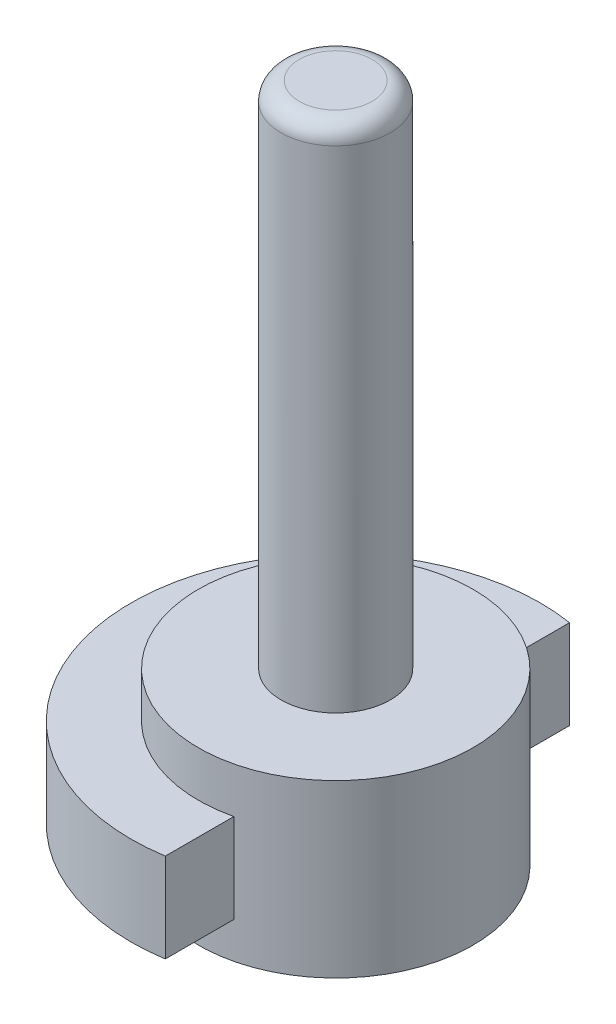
ISO-10303-21;
HEADER;
FILE_DESCRIPTION(('STEP AP214'),'2;1');
FILE_NAME('part.step','',(''),(''),'','','');
FILE_SCHEMA(('AUTOMOTIVE_DESIGN { 1 0 10303 214 1 1 1 1 }'));
ENDSEC;
DATA;
#1=APPLICATION_CONTEXT('core data for automotive mechanical design processes');
#2=APPLICATION_PROTOCOL_DEFINITION('international standard','automotive_design',2000,#1);
#3=PRODUCT_CONTEXT('',#1,'mechanical');
#4=PRODUCT('Part','Part','',(#3));
#5=PRODUCT_RELATED_PRODUCT_CATEGORY('part','',(#4));
#6=PRODUCT_DEFINITION_FORMATION('','',#4);
#7=PRODUCT_DEFINITION_CONTEXT('part definition',#1,'design');
#8=PRODUCT_DEFINITION('design','',#6,#7);
#9=PRODUCT_DEFINITION_SHAPE('','',#8);
#10=(LENGTH_UNIT() NAMED_UNIT(*) SI_UNIT(.MILLI.,.METRE.));
#11=(NAMED_UNIT(*) PLANE_ANGLE_UNIT() SI_UNIT($,.RADIAN.));
#12=(NAMED_UNIT(*) SI_UNIT($,.STERADIAN.) SOLID_ANGLE_UNIT());
#13=UNCERTAINTY_MEASURE_WITH_UNIT(LENGTH_MEASURE(1.E-05),#10,'distance_accuracy_value','');
#14=(GEOMETRIC_REPRESENTATION_CONTEXT(3) GLOBAL_UNCERTAINTY_ASSIGNED_CONTEXT((#13)) GLOBAL_UNIT_ASSIGNED_CONTEXT((#10,
#11,#12)) REPRESENTATION_CONTEXT('',''));
#15=CARTESIAN_POINT('',(0.,0.,0.));
#16=DIRECTION('',(0.,0.,1.));
#17=DIRECTION('',(1.,0.,0.));
#18=AXIS2_PLACEMENT_3D('',#15,#16,#17);
#19=CARTESIAN_POINT('',(0.,28.,0.));
#20=DIRECTION('',(0.,-1.,0.));
#21=DIRECTION('',(0.,0.,-1.));
#22=AXIS2_PLACEMENT_3D('',#19,#20,#21);
#23=CYLINDRICAL_SURFACE('',#22,3.);
#24=CARTESIAN_POINT('',(0.,27.,0.));
#25=DIRECTION('',(0.,1.,0.));
#26=DIRECTION('',(0.,0.,1.));
#27=AXIS2_PLACEMENT_3D('',#24,#25,#26);
#28=CIRCLE('',#27,3.);
#29=CARTESIAN_POINT('',(0.,27.,-3.));
#30=VERTEX_POINT('',#29);
#31=EDGE_CURVE('E37',#30,#30,#28,.F.);
#32=CARTESIAN_POINT('',(0.,0.,0.));
#33=DIRECTION('',(0.,1.,0.));
#34=DIRECTION('',(0.,0.,1.));
#35=AXIS2_PLACEMENT_3D('',#32,#33,#34);
#36=CIRCLE('',#35,3.);
#37=CARTESIAN_POINT('',(0.,0.,-3.));
#38=VERTEX_POINT('',#37);
#39=EDGE_CURVE('E104',#38,#38,#36,.T.);
#40=CARTESIAN_POINT('',(0.,27.,-3.));
#41=CARTESIAN_POINT('',(0.,26.71875,-3.));
#42=CARTESIAN_POINT('',(0.,26.4375,-3.));
#43=CARTESIAN_POINT('',(0.,25.875,-3.));
#44=CARTESIAN_POINT('',(0.,25.59375,-3.));
#45=CARTESIAN_POINT('',(0.,25.03125,-3.));
#46=CARTESIAN_POINT('',(0.,24.75,-3.));
#47=CARTESIAN_POINT('',(0.,24.1875,-3.));
#48=CARTESIAN_POINT('',(0.,23.90625,-3.));
#49=CARTESIAN_POINT('',(0.,23.34375,-3.));
#50=CARTESIAN_POINT('',(0.,23.0625,-3.));
#51=CARTESIAN_POINT('',(0.,22.5,-3.));
#52=CARTESIAN_POINT('',(0.,22.21875,-3.));
#53=CARTESIAN_POINT('',(0.,21.65625,-3.));
#54=CARTESIAN_POINT('',(0.,21.375,-3.));
#55=CARTESIAN_POINT('',(0.,20.8125,-3.));
#56=CARTESIAN_POINT('',(0.,20.53125,-3.));
#57=CARTESIAN_POINT('',(0.,19.96875,-3.));
#58=CARTESIAN_POINT('',(0.,19.6875,-3.));
#59=CARTESIAN_POINT('',(0.,19.125,-3.));
#60=CARTESIAN_POINT('',(0.,18.84375,-3.));
#61=CARTESIAN_POINT('',(0.,18.28125,-3.));
#62=CARTESIAN_POINT('',(0.,18.,-3.));
#63=CARTESIAN_POINT('',(0.,17.4375,-3.));
#64=CARTESIAN_POINT('',(0.,17.15625,-3.));
#65=CARTESIAN_POINT('',(0.,16.59375,-3.));
#66=CARTESIAN_POINT('',(0.,16.3125,-3.));
#67=CARTESIAN_POINT('',(0.,15.75,-3.));
#68=CARTESIAN_POINT('',(0.,15.46875,-3.));
#69=CARTESIAN_POINT('',(0.,14.90625,-3.));
#70=CARTESIAN_POINT('',(0.,14.625,-3.));
#71=CARTESIAN_POINT('',(0.,14.0625,-3.));
#72=CARTESIAN_POINT('',(0.,13.78125,-3.));
#73=CARTESIAN_POINT('',(0.,13.21875,-3.));
#74=CARTESIAN_POINT('',(0.,12.9375,-3.));
#75=CARTESIAN_POINT('',(0.,12.375,-3.));
#76=CARTESIAN_POINT('',(0.,12.09375,-3.));
#77=CARTESIAN_POINT('',(0.,11.53125,-3.));
#78=CARTESIAN_POINT('',(0.,11.25,-3.));
#79=CARTESIAN_POINT('',(0.,10.6875,-3.));
#80=CARTESIAN_POINT('',(0.,10.40625,-3.));
#81=CARTESIAN_POINT('',(0.,9.84375,-3.));
#82=CARTESIAN_POINT('',(0.,9.5625,-3.));
#83=CARTESIAN_POINT('',(0.,9.,-3.));
#84=CARTESIAN_POINT('',(0.,8.71875,-3.));
#85=CARTESIAN_POINT('',(0.,8.15625,-3.));
#86=CARTESIAN_POINT('',(0.,7.875,-3.));
#87=CARTESIAN_POINT('',(0.,7.3125,-3.));
#88=CARTESIAN_POINT('',(0.,7.03125,-3.));
#89=CARTESIAN_POINT('',(0.,6.46875,-3.));
#90=CARTESIAN_POINT('',(0.,6.18749999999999,-3.));
#91=CARTESIAN_POINT('',(0.,5.625,-3.));
#92=CARTESIAN_POINT('',(0.,5.34375,-3.));
#93=CARTESIAN_POINT('',(0.,4.78125,-3.));
#94=CARTESIAN_POINT('',(0.,4.5,-3.));
#95=CARTESIAN_POINT('',(0.,3.9375,-3.));
#96=CARTESIAN_POINT('',(0.,3.65625,-3.));
#97=CARTESIAN_POINT('',(0.,3.09375,-3.));
#98=CARTESIAN_POINT('',(0.,2.8125,-3.));
#99=CARTESIAN_POINT('',(0.,2.25,-3.));
#100=CARTESIAN_POINT('',(0.,1.96875,-3.));
#101=CARTESIAN_POINT('',(0.,1.40625,-3.));
#102=CARTESIAN_POINT('',(0.,1.125,-3.));
#103=CARTESIAN_POINT('',(0.,0.562499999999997,-3.));
#104=CARTESIAN_POINT('',(0.,0.281249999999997,-3.));
#105=CARTESIAN_POINT('',(0.,0.,-3.));
#106=B_SPLINE_CURVE_WITH_KNOTS('',3,(#40,#41,#42,#43,#44,#45,#46,#47,#48,#49,#50,#51,#52,#53,
#54,#55,#56,#57,#58,#59,#60,#61,#62,#63,#64,#65,#66,#67,#68,#69,#70,#71,#72,#73,#74,#75,#76,#77,
#78,#79,#80,#81,#82,#83,#84,#85,#86,#87,#88,#89,#90,#91,#92,#93,#94,#95,#96,#97,#98,#99,#100,
#101,#102,#103,#104,#105),.UNSPECIFIED.,.F.,.F.,(4,2,2,2,2,2,2,2,2,2,2,2,2,2,2,2,2,2,2,2,2,2,2,
2,2,2,2,2,2,2,2,2,4),(0.,0.843749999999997,1.6875,2.53125,3.375,4.21875,5.0625,5.90625,6.75,
7.59375,8.4375,9.28124999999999,10.125,10.96875,11.8125,12.65625,13.5,14.34375,15.1875,16.03125,
16.875,17.71875,18.5625,19.40625,20.25,21.09375,21.9375,22.78125,23.625,24.46875,25.3125,
26.15625,27.),.UNSPECIFIED.);
#107=EDGE_CURVE('BSEAM33',#30,#38,#106,.T.);
#108=ORIENTED_EDGE('',*,*,#31,.T.);
#109=ORIENTED_EDGE('',*,*,#39,.T.);
#110=ORIENTED_EDGE('',*,*,#107,.T.);
#111=ORIENTED_EDGE('',*,*,#107,.F.);
#112=EDGE_LOOP('',(#108,#110,#109,#111));
#113=FACE_BOUND('',#112,.T.);
#114=ADVANCED_FACE('F33',(#113),#23,.T.);
#115=CARTESIAN_POINT('',(0.,28.,0.));
#116=DIRECTION('',(0.,1.,0.));
#117=DIRECTION('',(0.,0.,1.));
#118=AXIS2_PLACEMENT_3D('',#115,#116,#117);
#119=PLANE('',#118);
#120=CARTESIAN_POINT('',(0.,28.,0.));
#121=DIRECTION('',(0.,1.,0.));
#122=DIRECTION('',(0.,0.,1.));
#123=AXIS2_PLACEMENT_3D('',#120,#121,#122);
#124=CIRCLE('',#123,2.);
#125=CARTESIAN_POINT('',(0.,28.,2.));
#126=VERTEX_POINT('',#125);
#127=EDGE_CURVE('E108',#126,#126,#124,.T.);
#128=ORIENTED_EDGE('',*,*,#127,.T.);
#129=EDGE_LOOP('',(#128));
#130=FACE_BOUND('',#129,.T.);
#131=ADVANCED_FACE('F131',(#130),#119,.T.);
#132=CARTESIAN_POINT('',(0.,-2.5,0.));
#133=DIRECTION('',(0.,1.,0.));
#134=DIRECTION('',(0.,0.,1.));
#135=AXIS2_PLACEMENT_3D('',#132,#133,#134);
#136=CYLINDRICAL_SURFACE('',#135,7.55);
#137=CARTESIAN_POINT('',(0.,-9.4,0.));
#138=DIRECTION('',(0.,-1.,0.));
#139=DIRECTION('',(0.,0.,-1.));
#140=AXIS2_PLACEMENT_3D('',#137,#138,#139);
#141=CIRCLE('',#140,7.55);
#142=CARTESIAN_POINT('',(0.,-9.4,-7.55));
#143=VERTEX_POINT('',#142);
#144=EDGE_CURVE('E95',#143,#143,#141,.T.);
#145=ORIENTED_EDGE('',*,*,#144,.F.);
#146=EDGE_LOOP('',(#145));
#147=FACE_BOUND('',#146,.T.);
#148=CARTESIAN_POINT('',(0.,-7.4,0.));
#149=DIRECTION('',(0.,-1.,0.));
#150=DIRECTION('',(0.,0.,-1.));
#151=AXIS2_PLACEMENT_3D('',#148,#149,#150);
#152=CIRCLE('',#151,7.55);
#153=CARTESIAN_POINT('',(1.74625496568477,-7.4,7.34527695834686));
#154=VERTEX_POINT('',#153);
#155=CARTESIAN_POINT('',(1.74625496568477,-7.4,-7.34527695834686));
#156=VERTEX_POINT('',#155);
#157=EDGE_CURVE('E11',#154,#156,#152,.T.);
#158=ORIENTED_EDGE('',*,*,#157,.T.);
#159=DIRECTION('',(0.,1.,0.));
#160=VECTOR('',#159,1.);
#161=CARTESIAN_POINT('',(1.74625496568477,-12.5,-7.34527695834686));
#162=LINE('',#161,#160);
#163=CARTESIAN_POINT('',(1.74625496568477,-2.5,-7.34527695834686));
#164=VERTEX_POINT('',#163);
#165=EDGE_CURVE('E226',#156,#164,#162,.T.);
#166=ORIENTED_EDGE('',*,*,#165,.T.);
#167=CARTESIAN_POINT('',(0.,-2.5,0.));
#168=DIRECTION('',(0.,-1.,0.));
#169=DIRECTION('',(0.,0.,-1.));
#170=AXIS2_PLACEMENT_3D('',#167,#168,#169);
#171=CIRCLE('',#170,7.55);
#172=CARTESIAN_POINT('',(1.74625496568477,-2.5,7.34527695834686));
#173=VERTEX_POINT('',#172);
#174=EDGE_CURVE('E89',#173,#164,#171,.T.);
#175=ORIENTED_EDGE('',*,*,#174,.F.);
#176=DIRECTION('',(0.,1.,0.));
#177=VECTOR('',#176,1.);
#178=CARTESIAN_POINT('',(1.74625496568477,-12.5,7.34527695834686));
#179=LINE('',#178,#177);
#180=EDGE_CURVE('E100',#154,#173,#179,.T.);
#181=ORIENTED_EDGE('',*,*,#180,.F.);
#182=EDGE_LOOP('',(#158,#166,#175,#181));
#183=FACE_BOUND('',#182,.T.);
#184=CARTESIAN_POINT('',(0.,0.,0.));
#185=DIRECTION('',(0.,-1.,0.));
#186=DIRECTION('',(0.,0.,-1.));
#187=AXIS2_PLACEMENT_3D('',#184,#185,#186);
#188=CIRCLE('',#187,7.55);
#189=CARTESIAN_POINT('',(0.,0.,-7.55));
#190=VERTEX_POINT('',#189);
#191=EDGE_CURVE('E97',#190,#190,#188,.T.);
#192=ORIENTED_EDGE('',*,*,#191,.T.);
#193=EDGE_LOOP('',(#192));
#194=FACE_BOUND('',#193,.T.);
#195=ADVANCED_FACE('F127',(#147,#183,#194),#136,.T.);
#196=CARTESIAN_POINT('',(0.,0.,0.));
#197=DIRECTION('',(0.,-1.,0.));
#198=DIRECTION('',(0.,0.,-1.));
#199=AXIS2_PLACEMENT_3D('',#196,#197,#198);
#200=PLANE('',#199);
#201=ORIENTED_EDGE('',*,*,#39,.F.);
#202=EDGE_LOOP('',(#201));
#203=FACE_BOUND('',#202,.T.);
#204=ORIENTED_EDGE('',*,*,#191,.F.);
#205=EDGE_LOOP('',(#204));
#206=FACE_BOUND('',#205,.T.);
#207=ADVANCED_FACE('F119',(#203,#206),#200,.F.);
#208=CARTESIAN_POINT('',(0.,27.,0.));
#209=DIRECTION('',(0.,1.,0.));
#210=DIRECTION('',(0.,0.,1.));
#211=AXIS2_PLACEMENT_3D('',#208,#209,#210);
#212=TOROIDAL_SURFACE('',#211,2.,1.);
#213=ORIENTED_EDGE('',*,*,#31,.F.);
#214=EDGE_LOOP('',(#213));
#215=FACE_BOUND('',#214,.T.);
#216=ORIENTED_EDGE('',*,*,#127,.F.);
#217=EDGE_LOOP('',(#216));
#218=FACE_BOUND('',#217,.T.);
#219=ADVANCED_FACE('F35',(#215,#218),#212,.T.);
#220=CARTESIAN_POINT('',(0.,-7.4,0.));
#221=DIRECTION('',(0.,1.,0.));
#222=DIRECTION('',(0.,0.,1.));
#223=AXIS2_PLACEMENT_3D('',#220,#221,#222);
#224=CYLINDRICAL_SURFACE('',#223,11.25);
#225=CARTESIAN_POINT('',(0.,-2.5,0.));
#226=DIRECTION('',(0.,-1.,0.));
#227=DIRECTION('',(0.,0.,-1.));
#228=AXIS2_PLACEMENT_3D('',#225,#226,#227);
#229=CIRCLE('',#228,11.25);
#230=CARTESIAN_POINT('',(1.74625496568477,-2.5,11.1136444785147));
#231=VERTEX_POINT('',#230);
#232=CARTESIAN_POINT('',(1.74625496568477,-2.5,-11.1136444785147));
#233=VERTEX_POINT('',#232);
#234=EDGE_CURVE('E87',#231,#233,#229,.T.);
#235=ORIENTED_EDGE('',*,*,#234,.T.);
#236=DIRECTION('',(0.,1.,0.));
#237=VECTOR('',#236,1.);
#238=CARTESIAN_POINT('',(1.74625496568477,-12.5,-11.1136444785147));
#239=LINE('',#238,#237);
#240=CARTESIAN_POINT('',(1.74625496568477,-7.4,-11.1136444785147));
#241=VERTEX_POINT('',#240);
#242=EDGE_CURVE('E73',#241,#233,#239,.T.);
#243=ORIENTED_EDGE('',*,*,#242,.F.);
#244=CARTESIAN_POINT('',(0.,-7.4,0.));
#245=DIRECTION('',(0.,-1.,0.));
#246=DIRECTION('',(0.,0.,-1.));
#247=AXIS2_PLACEMENT_3D('',#244,#245,#246);
#248=CIRCLE('',#247,11.25);
#249=CARTESIAN_POINT('',(1.74625496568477,-7.4,11.1136444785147));
#250=VERTEX_POINT('',#249);
#251=EDGE_CURVE('E94',#250,#241,#248,.T.);
#252=ORIENTED_EDGE('',*,*,#251,.F.);
#253=DIRECTION('',(0.,1.,0.));
#254=VECTOR('',#253,1.);
#255=CARTESIAN_POINT('',(1.74625496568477,-12.5,11.1136444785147));
#256=LINE('',#255,#254);
#257=EDGE_CURVE('E90',#250,#231,#256,.T.);
#258=ORIENTED_EDGE('',*,*,#257,.T.);
#259=EDGE_LOOP('',(#235,#243,#252,#258));
#260=FACE_BOUND('',#259,.T.);
#261=ADVANCED_FACE('F93',(#260),#224,.T.);
#262=CARTESIAN_POINT('',(0.,-7.4,0.));
#263=DIRECTION('',(0.,-1.,0.));
#264=DIRECTION('',(0.,0.,-1.));
#265=AXIS2_PLACEMENT_3D('',#262,#263,#264);
#266=PLANE('',#265);
#267=DIRECTION('',(0.,0.,-1.));
#268=VECTOR('',#267,1.);
#269=CARTESIAN_POINT('',(1.74625496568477,-7.4,0.));
#270=LINE('',#269,#268);
#271=EDGE_CURVE('E76',#156,#241,#270,.T.);
#272=ORIENTED_EDGE('',*,*,#271,.F.);
#273=ORIENTED_EDGE('',*,*,#157,.F.);
#274=DIRECTION('',(0.,0.,-1.));
#275=VECTOR('',#274,1.);
#276=CARTESIAN_POINT('',(1.74625496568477,-7.4,0.));
#277=LINE('',#276,#275);
#278=EDGE_CURVE('E49',#250,#154,#277,.T.);
#279=ORIENTED_EDGE('',*,*,#278,.F.);
#280=ORIENTED_EDGE('',*,*,#251,.T.);
#281=EDGE_LOOP('',(#272,#273,#279,#280));
#282=FACE_BOUND('',#281,.T.);
#283=ADVANCED_FACE('F125',(#282),#266,.T.);
#284=CARTESIAN_POINT('',(0.,-2.5,0.));
#285=DIRECTION('',(0.,-1.,0.));
#286=DIRECTION('',(0.,0.,-1.));
#287=AXIS2_PLACEMENT_3D('',#284,#285,#286);
#288=PLANE('',#287);
#289=ORIENTED_EDGE('',*,*,#174,.T.);
#290=DIRECTION('',(0.,0.,1.));
#291=VECTOR('',#290,1.);
#292=CARTESIAN_POINT('',(1.74625496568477,-2.5,-7.34527695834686));
#293=LINE('',#292,#291);
#294=EDGE_CURVE('E57',#233,#164,#293,.T.);
#295=ORIENTED_EDGE('',*,*,#294,.F.);
#296=ORIENTED_EDGE('',*,*,#234,.F.);
#297=DIRECTION('',(0.,0.,1.));
#298=VECTOR('',#297,1.);
#299=CARTESIAN_POINT('',(1.74625496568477,-2.5,7.34527695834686));
#300=LINE('',#299,#298);
#301=EDGE_CURVE('E233',#173,#231,#300,.T.);
#302=ORIENTED_EDGE('',*,*,#301,.F.);
#303=EDGE_LOOP('',(#289,#295,#296,#302));
#304=FACE_BOUND('',#303,.T.);
#305=ADVANCED_FACE('F85',(#304),#288,.F.);
#306=CARTESIAN_POINT('',(0.,-9.4,0.));
#307=DIRECTION('',(0.,-1.,0.));
#308=DIRECTION('',(0.,0.,-1.));
#309=AXIS2_PLACEMENT_3D('',#306,#307,#308);
#310=PLANE('',#309);
#311=ORIENTED_EDGE('',*,*,#144,.T.);
#312=EDGE_LOOP('',(#311));
#313=FACE_BOUND('',#312,.T.);
#314=ADVANCED_FACE('F142',(#313),#310,.T.);
#315=CARTESIAN_POINT('',(1.74625496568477,-12.5,-7.34527695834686));
#316=DIRECTION('',(-1.,0.,0.));
#317=DIRECTION('',(0.,0.,1.));
#318=AXIS2_PLACEMENT_3D('',#315,#316,#317);
#319=PLANE('',#318);
#320=ORIENTED_EDGE('',*,*,#271,.T.);
#321=ORIENTED_EDGE('',*,*,#242,.T.);
#322=ORIENTED_EDGE('',*,*,#294,.T.);
#323=ORIENTED_EDGE('',*,*,#165,.F.);
#324=EDGE_LOOP('',(#320,#321,#322,#323));
#325=FACE_BOUND('',#324,.T.);
#326=ADVANCED_FACE('F74',(#325),#319,.F.);
#327=CARTESIAN_POINT('',(1.74625496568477,-12.5,7.34527695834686));
#328=DIRECTION('',(-1.,0.,0.));
#329=DIRECTION('',(0.,0.,1.));
#330=AXIS2_PLACEMENT_3D('',#327,#328,#329);
#331=PLANE('',#330);
#332=ORIENTED_EDGE('',*,*,#278,.T.);
#333=ORIENTED_EDGE('',*,*,#180,.T.);
#334=ORIENTED_EDGE('',*,*,#301,.T.);
#335=ORIENTED_EDGE('',*,*,#257,.F.);
#336=EDGE_LOOP('',(#332,#333,#334,#335));
#337=FACE_BOUND('',#336,.T.);
#338=ADVANCED_FACE('F149',(#337),#331,.F.);
#339=CLOSED_SHELL('',(#114,#131,#195,#207,#219,#261,#283,#305,#314,#326,#338));
#340=MANIFOLD_SOLID_BREP('B2',#339);
#341=ADVANCED_BREP_SHAPE_REPRESENTATION('',(#18,#340),#14);
#342=SHAPE_DEFINITION_REPRESENTATION(#9,#341);
ENDSEC;
END-ISO-10303-21;
